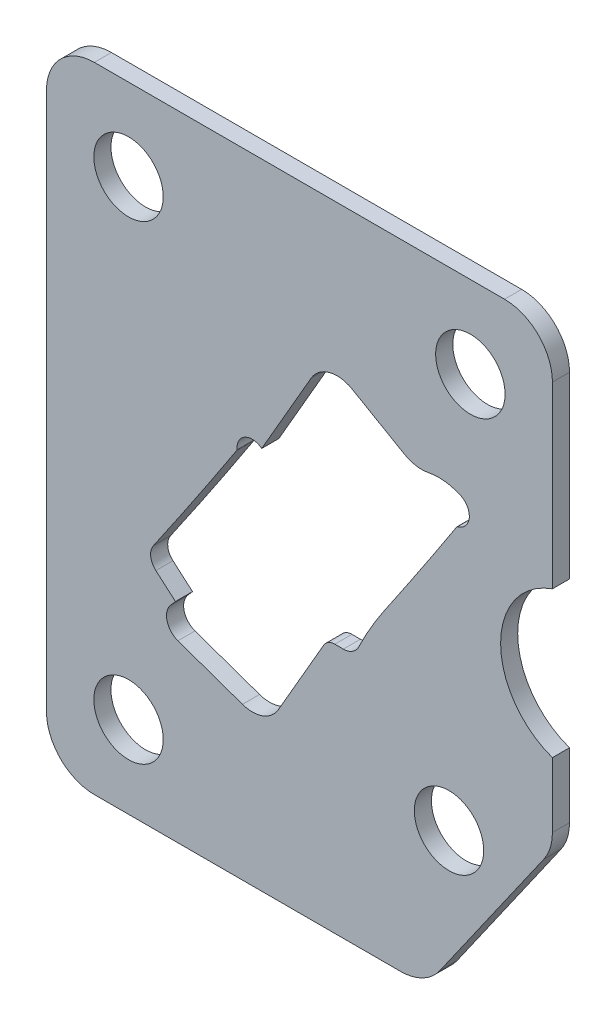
from build123d import *

# Parameters (mm, degrees)
BOSS_EXTRUDE1_DEPTH                            = 2.54
SKETCH3_R                                      = 11.509375
CUT_EXTRUDE1_DEPTH                             = 1125.969390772
HOLE1_D                                        = 10.3124
CUT_EXTRUDE1_QU250515L_PUNCH5_MOUNTED_IN_DEPTH = 1125.969390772


with BuildPart() as part:
    # Sketch2 → Boss-Extrude1 (new body)
    with BuildSketch(Plane.XY.offset(-29.21)):
        with BuildLine():
            Line((-1055.37, 58.547), (-1116.33, 58.547))
            ThreePointArc((-1116.33, 58.547), (-1121.358943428, 56.463943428), (-1123.442, 51.435))
            Line((-1123.442, 51.435), (-1123.442, -28.575))
            ThreePointArc((-1123.442, -28.575), (-1121.358943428, -33.603943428), (-1116.33, -35.687))
            Line((-1116.33, -35.687), (-1070.803470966, -35.687))
            ThreePointArc((-1070.803470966, -35.687), (-1067.519514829, -34.883421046), (-1064.977661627, -32.654275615))
            Line((-1064.977661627, -32.654275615), (-1049.544190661, -10.612994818))
            ThreePointArc((-1049.544190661, -10.612994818), (-1048.587165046, -8.672338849), (-1048.258, -6.533719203))
            Line((-1048.258, -6.533719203), (-1048.258, 51.435))
            ThreePointArc((-1048.258, 51.435), (-1050.341056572, 56.463943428), (-1055.37, 58.547))
        make_face()
    extrude(amount=-BOSS_EXTRUDE1_DEPTH)

    # Sketch3 → Cut-Extrude1 (cut, through all)
    with BuildSketch(Plane.XY.offset(-29.21)):
        with Locations((-1044.448, 13.97)):
            Circle(SKETCH3_R)
    extrude(amount=-CUT_EXTRUDE1_DEPTH, mode=Mode.SUBTRACT)

    # Hole1 (through all)
    with Locations(Plane(origin=(-1114.904260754, -12.893859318, -29.21), x_dir=(1, 0, 0), z_dir=(0, 0, 1))):
        with Locations((3.654260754, -10.601140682), (51.279260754, -1.076140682), (54.454260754, 59.248859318), (3.654260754, 59.248859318)):
            Hole(HOLE1_D / 2)

    # Sketch1 QU250515L_Punch5_Mounted in the → Cut-Extrude1 QU250515L_Punch5_Mounted in (cut, through all)
    with BuildSketch(Plane.XY.offset(-29.21)):
        with BuildLine():
            Line((-1080.596105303, 1.541052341), (-1079.326105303, 1.541052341))
            ThreePointArc((-1079.326105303, 1.541052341), (-1077.978516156, 1.928007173), (-1077.04152239, 2.970970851))
            ThreePointArc((-1077.04152239, 2.970970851), (-1075.331374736, 6.198155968), (-1073.399755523, 9.297861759))
            ThreePointArc((-1073.399755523, 9.297861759), (-1067.893790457, 17.454554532), (-1062.482897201, 25.674622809))
            ThreePointArc((-1062.482897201, 25.674622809), (-1062.417197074, 25.743150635), (-1062.330924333, 25.78276861))
            ThreePointArc((-1062.330924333, 25.78276861), (-1060.608673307, 27.877017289), (-1062.121441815, 30.127252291))
            Line((-1062.121441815, 30.127252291), (-1062.600552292, 30.296122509))
            ThreePointArc((-1062.600552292, 30.296122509), (-1064.615145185, 30.711807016), (-1066.667520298, 30.573479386))
            ThreePointArc((-1066.667520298, 30.573479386), (-1068.501755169, 30.534744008), (-1070.230130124, 31.150079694))
            Line((-1070.230130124, 31.150079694), (-1078.034254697, 35.655793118))
            ThreePointArc((-1078.034254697, 35.655793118), (-1081.407205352, 36.099850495), (-1084.106237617, 34.028810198))
            Line((-1084.106237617, 34.028810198), (-1091.459908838, 21.29187802))
            ThreePointArc((-1091.459908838, 21.29187802), (-1093.934138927, 21.516580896), (-1095.132350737, 19.34020906))
            ThreePointArc((-1095.132350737, 19.34020906), (-1095.139594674, 19.257839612), (-1095.172911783, 19.182161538))
            ThreePointArc((-1095.172911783, 19.182161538), (-1101.30976582, 9.910657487), (-1107.566377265, 0.719543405))
            ThreePointArc((-1107.566377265, 0.719543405), (-1107.950280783, -0.854722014), (-1107.18662756, -2.28389215))
            Line((-1107.18662756, -2.28389215), (-1104.278124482, -4.809720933))
            Line((-1104.278124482, -4.809720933), (-1104.981525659, -5.619690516))
            ThreePointArc((-1104.981525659, -5.619690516), (-1105.519411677, -7.934236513), (-1103.908100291, -9.680695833))
            Line((-1103.908100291, -9.680695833), (-1094.316561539, -13.061388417))
            ThreePointArc((-1094.316561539, -13.061388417), (-1091.297394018, -13.038301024), (-1088.989464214, -11.091671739))
            Line((-1088.989464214, -11.091671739), (-1082.245883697, 0.588552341))
            ThreePointArc((-1082.245883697, 0.588552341), (-1081.548605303, 1.285830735), (-1080.596105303, 1.541052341))
        make_face()
    extrude(amount=-CUT_EXTRUDE1_QU250515L_PUNCH5_MOUNTED_IN_DEPTH, mode=Mode.SUBTRACT)


solid = part.part
